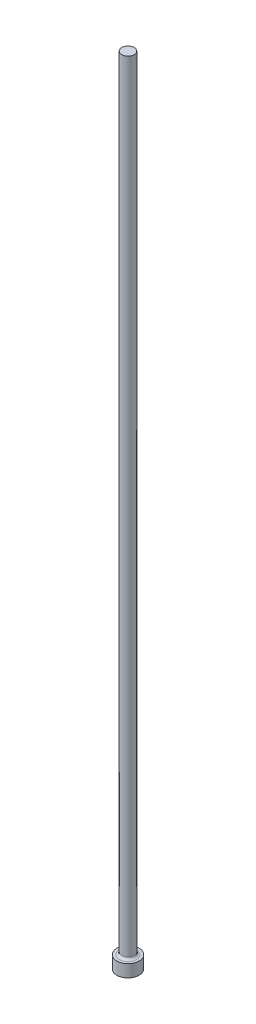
ISO-10303-21;
HEADER;
FILE_DESCRIPTION(('STEP AP214'),'2;1');
FILE_NAME('part.step','',(''),(''),'','','');
FILE_SCHEMA(('AUTOMOTIVE_DESIGN { 1 0 10303 214 1 1 1 1 }'));
ENDSEC;
DATA;
#1=APPLICATION_CONTEXT('core data for automotive mechanical design processes');
#2=APPLICATION_PROTOCOL_DEFINITION('international standard','automotive_design',2000,#1);
#3=PRODUCT_CONTEXT('',#1,'mechanical');
#4=PRODUCT('Part','Part','',(#3));
#5=PRODUCT_RELATED_PRODUCT_CATEGORY('part','',(#4));
#6=PRODUCT_DEFINITION_FORMATION('','',#4);
#7=PRODUCT_DEFINITION_CONTEXT('part definition',#1,'design');
#8=PRODUCT_DEFINITION('design','',#6,#7);
#9=PRODUCT_DEFINITION_SHAPE('','',#8);
#10=(LENGTH_UNIT() NAMED_UNIT(*) SI_UNIT(.MILLI.,.METRE.));
#11=(NAMED_UNIT(*) PLANE_ANGLE_UNIT() SI_UNIT($,.RADIAN.));
#12=(NAMED_UNIT(*) SI_UNIT($,.STERADIAN.) SOLID_ANGLE_UNIT());
#13=UNCERTAINTY_MEASURE_WITH_UNIT(LENGTH_MEASURE(1.E-05),#10,'distance_accuracy_value','');
#14=(GEOMETRIC_REPRESENTATION_CONTEXT(3) GLOBAL_UNCERTAINTY_ASSIGNED_CONTEXT((#13)) GLOBAL_UNIT_ASSIGNED_CONTEXT((#10,
#11,#12)) REPRESENTATION_CONTEXT('',''));
#15=CARTESIAN_POINT('',(0.,0.,0.));
#16=DIRECTION('',(0.,0.,1.));
#17=DIRECTION('',(1.,0.,0.));
#18=AXIS2_PLACEMENT_3D('',#15,#16,#17);
#19=CARTESIAN_POINT('',(1.98374,254.,0.));
#20=DIRECTION('',(0.,-1.,0.));
#21=DIRECTION('',(1.,0.,0.));
#22=AXIS2_PLACEMENT_3D('',#19,#20,#21);
#23=PLANE('',#22);
#24=CARTESIAN_POINT('',(0.,254.,0.));
#25=DIRECTION('',(0.,1.,0.));
#26=DIRECTION('',(-1.,0.,0.));
#27=AXIS2_PLACEMENT_3D('',#24,#25,#26);
#28=CIRCLE('',#27,1.98374000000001);
#29=CARTESIAN_POINT('',(-1.98374000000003,254.,0.));
#30=VERTEX_POINT('',#29);
#31=EDGE_CURVE('E10',#30,#30,#28,.T.);
#32=ORIENTED_EDGE('',*,*,#31,.T.);
#33=EDGE_LOOP('',(#32));
#34=FACE_BOUND('',#33,.T.);
#35=ADVANCED_FACE('F30',(#34),#23,.F.);
#36=CARTESIAN_POINT('',(0.,254.,0.));
#37=DIRECTION('',(0.,1.,0.));
#38=DIRECTION('',(-1.,0.,0.));
#39=AXIS2_PLACEMENT_3D('',#36,#37,#38);
#40=CYLINDRICAL_SURFACE('',#39,1.98374000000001);
#41=ORIENTED_EDGE('',*,*,#31,.F.);
#42=EDGE_LOOP('',(#41));
#43=FACE_BOUND('',#42,.T.);
#44=CARTESIAN_POINT('',(0.,4.72440000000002,0.));
#45=DIRECTION('',(0.,1.,0.));
#46=DIRECTION('',(-1.,0.,0.));
#47=AXIS2_PLACEMENT_3D('',#44,#45,#46);
#48=CIRCLE('',#47,1.98374);
#49=CARTESIAN_POINT('',(-1.98374,4.72440000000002,0.));
#50=VERTEX_POINT('',#49);
#51=EDGE_CURVE('E36',#50,#50,#48,.T.);
#52=ORIENTED_EDGE('',*,*,#51,.T.);
#53=EDGE_LOOP('',(#52));
#54=FACE_BOUND('',#53,.T.);
#55=ADVANCED_FACE('F65',(#43,#54),#40,.T.);
#56=CARTESIAN_POINT('',(0.,4.7244,0.));
#57=DIRECTION('',(0.,1.,0.));
#58=DIRECTION('',(-1.,0.,0.));
#59=AXIS2_PLACEMENT_3D('',#56,#57,#58);
#60=TOROIDAL_SURFACE('',#59,2.74574,0.762);
#61=ORIENTED_EDGE('',*,*,#51,.F.);
#62=EDGE_LOOP('',(#61));
#63=FACE_BOUND('',#62,.T.);
#64=CARTESIAN_POINT('',(0.,3.96239999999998,0.));
#65=DIRECTION('',(0.,1.,0.));
#66=DIRECTION('',(-1.,0.,0.));
#67=AXIS2_PLACEMENT_3D('',#64,#65,#66);
#68=CIRCLE('',#67,2.74574000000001);
#69=CARTESIAN_POINT('',(-2.74574000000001,3.96239999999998,0.));
#70=VERTEX_POINT('',#69);
#71=EDGE_CURVE('E40',#70,#70,#68,.T.);
#72=ORIENTED_EDGE('',*,*,#71,.T.);
#73=EDGE_LOOP('',(#72));
#74=FACE_BOUND('',#73,.T.);
#75=ADVANCED_FACE('F69',(#63,#74),#60,.F.);
#76=CARTESIAN_POINT('',(3.556,3.9624,0.));
#77=DIRECTION('',(0.,-1.,0.));
#78=DIRECTION('',(1.,0.,0.));
#79=AXIS2_PLACEMENT_3D('',#76,#77,#78);
#80=PLANE('',#79);
#81=ORIENTED_EDGE('',*,*,#71,.F.);
#82=EDGE_LOOP('',(#81));
#83=FACE_BOUND('',#82,.T.);
#84=CARTESIAN_POINT('',(0.,3.96239999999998,0.));
#85=DIRECTION('',(0.,1.,0.));
#86=DIRECTION('',(-1.,0.,0.));
#87=AXIS2_PLACEMENT_3D('',#84,#85,#86);
#88=CIRCLE('',#87,3.556);
#89=CARTESIAN_POINT('',(-3.556,3.96239999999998,0.));
#90=VERTEX_POINT('',#89);
#91=EDGE_CURVE('E44',#90,#90,#88,.T.);
#92=ORIENTED_EDGE('',*,*,#91,.T.);
#93=EDGE_LOOP('',(#92));
#94=FACE_BOUND('',#93,.T.);
#95=ADVANCED_FACE('F61',(#83,#94),#80,.F.);
#96=CARTESIAN_POINT('',(0.,254.,0.));
#97=DIRECTION('',(0.,1.,0.));
#98=DIRECTION('',(-1.,0.,0.));
#99=AXIS2_PLACEMENT_3D('',#96,#97,#98);
#100=CYLINDRICAL_SURFACE('',#99,3.556);
#101=ORIENTED_EDGE('',*,*,#91,.F.);
#102=EDGE_LOOP('',(#101));
#103=FACE_BOUND('',#102,.T.);
#104=CARTESIAN_POINT('',(0.,0.,0.));
#105=DIRECTION('',(0.,1.,0.));
#106=DIRECTION('',(-1.,0.,0.));
#107=AXIS2_PLACEMENT_3D('',#104,#105,#106);
#108=CIRCLE('',#107,3.556);
#109=CARTESIAN_POINT('',(-3.556,0.,0.));
#110=VERTEX_POINT('',#109);
#111=EDGE_CURVE('E49',#110,#110,#108,.T.);
#112=ORIENTED_EDGE('',*,*,#111,.T.);
#113=EDGE_LOOP('',(#112));
#114=FACE_BOUND('',#113,.T.);
#115=ADVANCED_FACE('F53',(#103,#114),#100,.T.);
#116=CARTESIAN_POINT('',(0.,0.,0.));
#117=DIRECTION('',(0.,1.,0.));
#118=DIRECTION('',(-1.,0.,0.));
#119=AXIS2_PLACEMENT_3D('',#116,#117,#118);
#120=PLANE('',#119);
#121=ORIENTED_EDGE('',*,*,#111,.F.);
#122=EDGE_LOOP('',(#121));
#123=FACE_BOUND('',#122,.T.);
#124=ADVANCED_FACE('F55',(#123),#120,.F.);
#125=CLOSED_SHELL('',(#35,#55,#75,#95,#115,#124));
#126=MANIFOLD_SOLID_BREP('B2',#125);
#127=ADVANCED_BREP_SHAPE_REPRESENTATION('',(#18,#126),#14);
#128=SHAPE_DEFINITION_REPRESENTATION(#9,#127);
ENDSEC;
END-ISO-10303-21;
